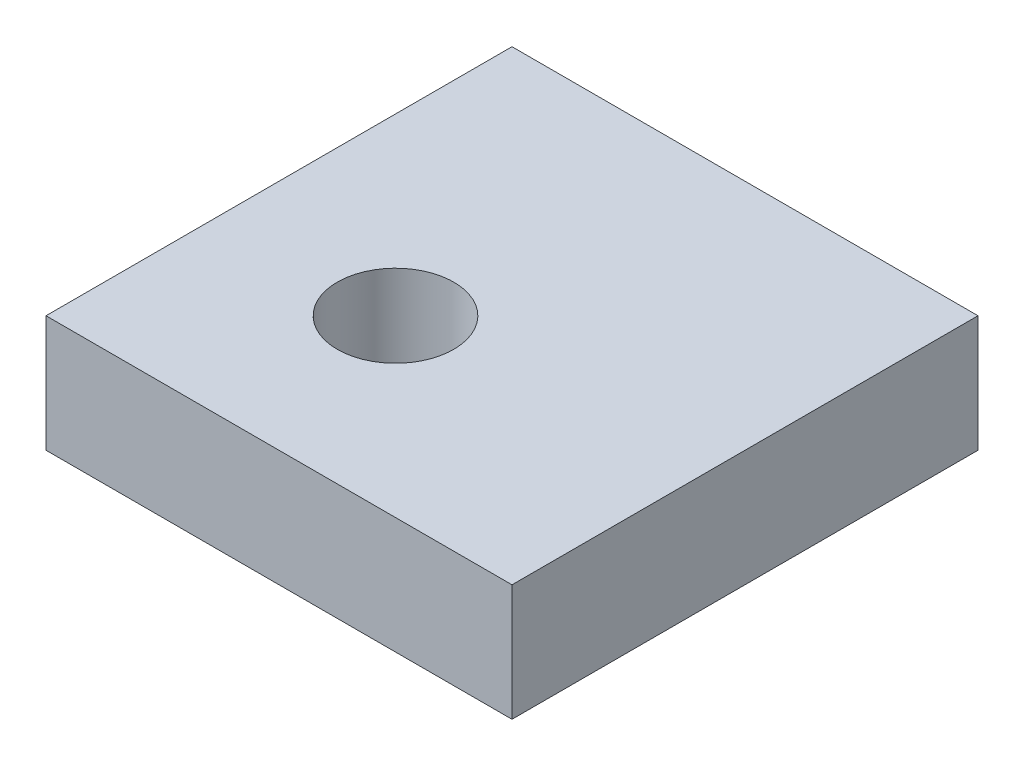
ISO-10303-21;
HEADER;
FILE_DESCRIPTION(('STEP AP214'),'2;1');
FILE_NAME('part.step','',(''),(''),'','','');
FILE_SCHEMA(('AUTOMOTIVE_DESIGN { 1 0 10303 214 1 1 1 1 }'));
ENDSEC;
DATA;
#1=APPLICATION_CONTEXT('core data for automotive mechanical design processes');
#2=APPLICATION_PROTOCOL_DEFINITION('international standard','automotive_design',2000,#1);
#3=PRODUCT_CONTEXT('',#1,'mechanical');
#4=PRODUCT('Part','Part','',(#3));
#5=PRODUCT_RELATED_PRODUCT_CATEGORY('part','',(#4));
#6=PRODUCT_DEFINITION_FORMATION('','',#4);
#7=PRODUCT_DEFINITION_CONTEXT('part definition',#1,'design');
#8=PRODUCT_DEFINITION('design','',#6,#7);
#9=PRODUCT_DEFINITION_SHAPE('','',#8);
#10=(LENGTH_UNIT() NAMED_UNIT(*) SI_UNIT(.MILLI.,.METRE.));
#11=(NAMED_UNIT(*) PLANE_ANGLE_UNIT() SI_UNIT($,.RADIAN.));
#12=(NAMED_UNIT(*) SI_UNIT($,.STERADIAN.) SOLID_ANGLE_UNIT());
#13=UNCERTAINTY_MEASURE_WITH_UNIT(LENGTH_MEASURE(1.E-05),#10,'distance_accuracy_value','');
#14=(GEOMETRIC_REPRESENTATION_CONTEXT(3) GLOBAL_UNCERTAINTY_ASSIGNED_CONTEXT((#13)) GLOBAL_UNIT_ASSIGNED_CONTEXT((#10,
#11,#12)) REPRESENTATION_CONTEXT('',''));
#15=CARTESIAN_POINT('',(0.,0.,0.));
#16=DIRECTION('',(0.,0.,1.));
#17=DIRECTION('',(1.,0.,0.));
#18=AXIS2_PLACEMENT_3D('',#15,#16,#17);
#19=CARTESIAN_POINT('',(6.35,3.175,6.35));
#20=DIRECTION('',(-1.,0.,0.));
#21=DIRECTION('',(0.,0.,1.));
#22=AXIS2_PLACEMENT_3D('',#19,#20,#21);
#23=PLANE('',#22);
#24=DIRECTION('',(0.,0.,-1.));
#25=VECTOR('',#24,1.);
#26=CARTESIAN_POINT('',(6.35,0.,6.35));
#27=LINE('',#26,#25);
#28=CARTESIAN_POINT('',(6.35,0.,6.35));
#29=VERTEX_POINT('',#28);
#30=CARTESIAN_POINT('',(6.35,0.,-6.35));
#31=VERTEX_POINT('',#30);
#32=EDGE_CURVE('E98',#29,#31,#27,.T.);
#33=ORIENTED_EDGE('',*,*,#32,.T.);
#34=DIRECTION('',(0.,-1.,0.));
#35=VECTOR('',#34,1.);
#36=CARTESIAN_POINT('',(6.35,3.175,-6.35));
#37=LINE('',#36,#35);
#38=CARTESIAN_POINT('',(6.35,3.175,-6.35));
#39=VERTEX_POINT('',#38);
#40=EDGE_CURVE('E11',#39,#31,#37,.T.);
#41=ORIENTED_EDGE('',*,*,#40,.F.);
#42=DIRECTION('',(0.,0.,-1.));
#43=VECTOR('',#42,1.);
#44=CARTESIAN_POINT('',(6.35,3.175,6.35));
#45=LINE('',#44,#43);
#46=CARTESIAN_POINT('',(6.35,3.175,6.35));
#47=VERTEX_POINT('',#46);
#48=EDGE_CURVE('E86',#47,#39,#45,.T.);
#49=ORIENTED_EDGE('',*,*,#48,.F.);
#50=DIRECTION('',(0.,-1.,0.));
#51=VECTOR('',#50,1.);
#52=CARTESIAN_POINT('',(6.35,3.175,6.35));
#53=LINE('',#52,#51);
#54=EDGE_CURVE('E94',#47,#29,#53,.T.);
#55=ORIENTED_EDGE('',*,*,#54,.T.);
#56=EDGE_LOOP('',(#33,#41,#49,#55));
#57=FACE_BOUND('',#56,.T.);
#58=ADVANCED_FACE('F35',(#57),#23,.F.);
#59=CARTESIAN_POINT('',(-6.35,3.175,-6.35));
#60=DIRECTION('',(0.,0.,1.));
#61=DIRECTION('',(1.,0.,0.));
#62=AXIS2_PLACEMENT_3D('',#59,#60,#61);
#63=PLANE('',#62);
#64=DIRECTION('',(-1.,0.,0.));
#65=VECTOR('',#64,1.);
#66=CARTESIAN_POINT('',(-6.35,0.,-6.35));
#67=LINE('',#66,#65);
#68=CARTESIAN_POINT('',(-6.35,0.,-6.35));
#69=VERTEX_POINT('',#68);
#70=EDGE_CURVE('E90',#31,#69,#67,.T.);
#71=ORIENTED_EDGE('',*,*,#70,.T.);
#72=DIRECTION('',(0.,-1.,0.));
#73=VECTOR('',#72,1.);
#74=CARTESIAN_POINT('',(-6.35,3.175,-6.35));
#75=LINE('',#74,#73);
#76=CARTESIAN_POINT('',(-6.35,3.175,-6.35));
#77=VERTEX_POINT('',#76);
#78=EDGE_CURVE('E43',#77,#69,#75,.T.);
#79=ORIENTED_EDGE('',*,*,#78,.F.);
#80=DIRECTION('',(-1.,0.,0.));
#81=VECTOR('',#80,1.);
#82=CARTESIAN_POINT('',(-6.35,3.175,-6.35));
#83=LINE('',#82,#81);
#84=EDGE_CURVE('E81',#39,#77,#83,.T.);
#85=ORIENTED_EDGE('',*,*,#84,.F.);
#86=ORIENTED_EDGE('',*,*,#40,.T.);
#87=EDGE_LOOP('',(#71,#79,#85,#86));
#88=FACE_BOUND('',#87,.T.);
#89=ADVANCED_FACE('F89',(#88),#63,.F.);
#90=CARTESIAN_POINT('',(-6.35,3.175,6.35));
#91=DIRECTION('',(1.,0.,0.));
#92=DIRECTION('',(0.,0.,-1.));
#93=AXIS2_PLACEMENT_3D('',#90,#91,#92);
#94=PLANE('',#93);
#95=DIRECTION('',(0.,0.,1.));
#96=VECTOR('',#95,1.);
#97=CARTESIAN_POINT('',(-6.35,0.,6.35));
#98=LINE('',#97,#96);
#99=CARTESIAN_POINT('',(-6.35,0.,6.35));
#100=VERTEX_POINT('',#99);
#101=EDGE_CURVE('E68',#69,#100,#98,.T.);
#102=ORIENTED_EDGE('',*,*,#101,.T.);
#103=DIRECTION('',(0.,-1.,0.));
#104=VECTOR('',#103,1.);
#105=CARTESIAN_POINT('',(-6.35,3.175,6.35));
#106=LINE('',#105,#104);
#107=CARTESIAN_POINT('',(-6.35,3.175,6.35));
#108=VERTEX_POINT('',#107);
#109=EDGE_CURVE('E91',#108,#100,#106,.T.);
#110=ORIENTED_EDGE('',*,*,#109,.F.);
#111=DIRECTION('',(0.,0.,1.));
#112=VECTOR('',#111,1.);
#113=CARTESIAN_POINT('',(-6.35,3.175,6.35));
#114=LINE('',#113,#112);
#115=EDGE_CURVE('E84',#77,#108,#114,.T.);
#116=ORIENTED_EDGE('',*,*,#115,.F.);
#117=ORIENTED_EDGE('',*,*,#78,.T.);
#118=EDGE_LOOP('',(#102,#110,#116,#117));
#119=FACE_BOUND('',#118,.T.);
#120=ADVANCED_FACE('F92',(#119),#94,.F.);
#121=CARTESIAN_POINT('',(-6.35,3.175,6.35));
#122=DIRECTION('',(0.,0.,-1.));
#123=DIRECTION('',(-1.,0.,0.));
#124=AXIS2_PLACEMENT_3D('',#121,#122,#123);
#125=PLANE('',#124);
#126=DIRECTION('',(1.,0.,0.));
#127=VECTOR('',#126,1.);
#128=CARTESIAN_POINT('',(-6.35,0.,6.35));
#129=LINE('',#128,#127);
#130=EDGE_CURVE('E74',#100,#29,#129,.T.);
#131=ORIENTED_EDGE('',*,*,#130,.T.);
#132=ORIENTED_EDGE('',*,*,#54,.F.);
#133=DIRECTION('',(1.,0.,0.));
#134=VECTOR('',#133,1.);
#135=CARTESIAN_POINT('',(-6.35,3.175,6.35));
#136=LINE('',#135,#134);
#137=EDGE_CURVE('E51',#108,#47,#136,.T.);
#138=ORIENTED_EDGE('',*,*,#137,.F.);
#139=ORIENTED_EDGE('',*,*,#109,.T.);
#140=EDGE_LOOP('',(#131,#132,#138,#139));
#141=FACE_BOUND('',#140,.T.);
#142=ADVANCED_FACE('F106',(#141),#125,.F.);
#143=CARTESIAN_POINT('',(0.,3.175,0.));
#144=DIRECTION('',(0.,-1.,0.));
#145=DIRECTION('',(0.,0.,-1.));
#146=AXIS2_PLACEMENT_3D('',#143,#144,#145);
#147=PLANE('',#146);
#148=CARTESIAN_POINT('',(-1.5875,3.175,1.5875));
#149=DIRECTION('',(0.,1.,0.));
#150=DIRECTION('',(0.,0.,1.));
#151=AXIS2_PLACEMENT_3D('',#148,#149,#150);
#152=CIRCLE('',#151,1.5875);
#153=CARTESIAN_POINT('',(-1.5875,3.175,3.175));
#154=VERTEX_POINT('',#153);
#155=EDGE_CURVE('E112',#154,#154,#152,.T.);
#156=ORIENTED_EDGE('',*,*,#155,.F.);
#157=EDGE_LOOP('',(#156));
#158=FACE_BOUND('',#157,.T.);
#159=ORIENTED_EDGE('',*,*,#48,.T.);
#160=ORIENTED_EDGE('',*,*,#84,.T.);
#161=ORIENTED_EDGE('',*,*,#115,.T.);
#162=ORIENTED_EDGE('',*,*,#137,.T.);
#163=EDGE_LOOP('',(#159,#160,#161,#162));
#164=FACE_BOUND('',#163,.T.);
#165=ADVANCED_FACE('F82',(#158,#164),#147,.F.);
#166=CARTESIAN_POINT('',(0.,0.,0.));
#167=DIRECTION('',(0.,-1.,0.));
#168=DIRECTION('',(0.,0.,-1.));
#169=AXIS2_PLACEMENT_3D('',#166,#167,#168);
#170=PLANE('',#169);
#171=CARTESIAN_POINT('',(-1.5875,0.,1.5875));
#172=DIRECTION('',(0.,1.,0.));
#173=DIRECTION('',(0.,0.,1.));
#174=AXIS2_PLACEMENT_3D('',#171,#172,#173);
#175=CIRCLE('',#174,1.5875);
#176=CARTESIAN_POINT('',(-1.5875,0.,3.175));
#177=VERTEX_POINT('',#176);
#178=EDGE_CURVE('E101',#177,#177,#175,.T.);
#179=ORIENTED_EDGE('',*,*,#178,.T.);
#180=EDGE_LOOP('',(#179));
#181=FACE_BOUND('',#180,.T.);
#182=ORIENTED_EDGE('',*,*,#32,.F.);
#183=ORIENTED_EDGE('',*,*,#130,.F.);
#184=ORIENTED_EDGE('',*,*,#101,.F.);
#185=ORIENTED_EDGE('',*,*,#70,.F.);
#186=EDGE_LOOP('',(#182,#183,#184,#185));
#187=FACE_BOUND('',#186,.T.);
#188=ADVANCED_FACE('F109',(#181,#187),#170,.T.);
#189=CARTESIAN_POINT('',(-1.5875,0.,1.5875));
#190=DIRECTION('',(0.,1.,0.));
#191=DIRECTION('',(0.,0.,1.));
#192=AXIS2_PLACEMENT_3D('',#189,#190,#191);
#193=CYLINDRICAL_SURFACE('',#192,1.5875);
#194=ORIENTED_EDGE('',*,*,#178,.F.);
#195=EDGE_LOOP('',(#194));
#196=FACE_BOUND('',#195,.T.);
#197=ORIENTED_EDGE('',*,*,#155,.T.);
#198=EDGE_LOOP('',(#197));
#199=FACE_BOUND('',#198,.T.);
#200=ADVANCED_FACE('F119',(#196,#199),#193,.F.);
#201=CLOSED_SHELL('',(#58,#89,#120,#142,#165,#188,#200));
#202=MANIFOLD_SOLID_BREP('B2',#201);
#203=ADVANCED_BREP_SHAPE_REPRESENTATION('',(#18,#202),#14);
#204=SHAPE_DEFINITION_REPRESENTATION(#9,#203);
ENDSEC;
END-ISO-10303-21;
